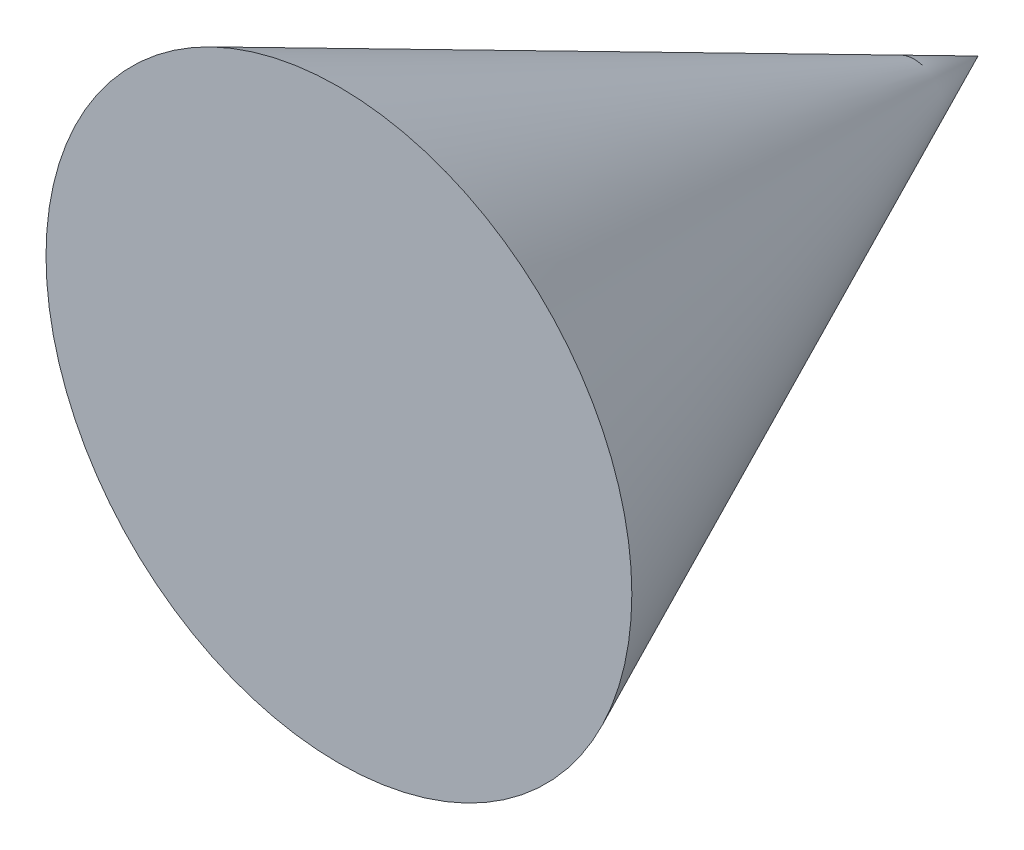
ISO-10303-21;
HEADER;
FILE_DESCRIPTION(('STEP AP214'),'2;1');
FILE_NAME('part.step','',(''),(''),'','','');
FILE_SCHEMA(('AUTOMOTIVE_DESIGN { 1 0 10303 214 1 1 1 1 }'));
ENDSEC;
DATA;
#1=APPLICATION_CONTEXT('core data for automotive mechanical design processes');
#2=APPLICATION_PROTOCOL_DEFINITION('international standard','automotive_design',2000,#1);
#3=PRODUCT_CONTEXT('',#1,'mechanical');
#4=PRODUCT('Part','Part','',(#3));
#5=PRODUCT_RELATED_PRODUCT_CATEGORY('part','',(#4));
#6=PRODUCT_DEFINITION_FORMATION('','',#4);
#7=PRODUCT_DEFINITION_CONTEXT('part definition',#1,'design');
#8=PRODUCT_DEFINITION('design','',#6,#7);
#9=PRODUCT_DEFINITION_SHAPE('','',#8);
#10=(LENGTH_UNIT() NAMED_UNIT(*) SI_UNIT(.MILLI.,.METRE.));
#11=(NAMED_UNIT(*) PLANE_ANGLE_UNIT() SI_UNIT($,.RADIAN.));
#12=(NAMED_UNIT(*) SI_UNIT($,.STERADIAN.) SOLID_ANGLE_UNIT());
#13=UNCERTAINTY_MEASURE_WITH_UNIT(LENGTH_MEASURE(1.E-05),#10,'distance_accuracy_value','');
#14=(GEOMETRIC_REPRESENTATION_CONTEXT(3) GLOBAL_UNCERTAINTY_ASSIGNED_CONTEXT((#13)) GLOBAL_UNIT_ASSIGNED_CONTEXT((#10,
#11,#12)) REPRESENTATION_CONTEXT('',''));
#15=CARTESIAN_POINT('',(0.,0.,0.));
#16=DIRECTION('',(0.,0.,1.));
#17=DIRECTION('',(1.,0.,0.));
#18=AXIS2_PLACEMENT_3D('',#15,#16,#17);
#19=CARTESIAN_POINT('',(0.,0.,-40.3438179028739));
#20=DIRECTION('',(0.,0.,1.));
#21=DIRECTION('',(1.,0.,0.));
#22=AXIS2_PLACEMENT_3D('',#19,#20,#21);
#23=CONICAL_SURFACE('',#22,0.,0.429775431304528);
#24=CARTESIAN_POINT('',(0.,0.,14.1997426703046));
#25=DIRECTION('',(0.,0.,-1.));
#26=DIRECTION('',(-1.,0.,0.));
#27=AXIS2_PLACEMENT_3D('',#24,#25,#26);
#28=CIRCLE('',#27,25.);
#29=CARTESIAN_POINT('',(-25.,0.,14.1997426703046));
#30=VERTEX_POINT('',#29);
#31=EDGE_CURVE('E11',#30,#30,#28,.T.);
#32=ORIENTED_EDGE('',*,*,#31,.T.);
#33=EDGE_LOOP('',(#32));
#34=FACE_BOUND('',#33,.T.);
#35=CARTESIAN_POINT('',(0.,0.,-40.3438179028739));
#36=VERTEX_POINT('',#35);
#37=VERTEX_LOOP('',#36);
#38=FACE_BOUND('',#37,.T.);
#39=ADVANCED_FACE('F31',(#34,#38),#23,.T.);
#40=CARTESIAN_POINT('',(-25.,0.,14.1997426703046));
#41=DIRECTION('',(0.,0.,1.));
#42=DIRECTION('',(1.,0.,0.));
#43=AXIS2_PLACEMENT_3D('',#40,#41,#42);
#44=PLANE('',#43);
#45=ORIENTED_EDGE('',*,*,#31,.F.);
#46=EDGE_LOOP('',(#45));
#47=FACE_BOUND('',#46,.T.);
#48=ADVANCED_FACE('F39',(#47),#44,.T.);
#49=CLOSED_SHELL('',(#39,#48));
#50=MANIFOLD_SOLID_BREP('B2',#49);
#51=ADVANCED_BREP_SHAPE_REPRESENTATION('',(#18,#50),#14);
#52=SHAPE_DEFINITION_REPRESENTATION(#9,#51);
ENDSEC;
END-ISO-10303-21;
